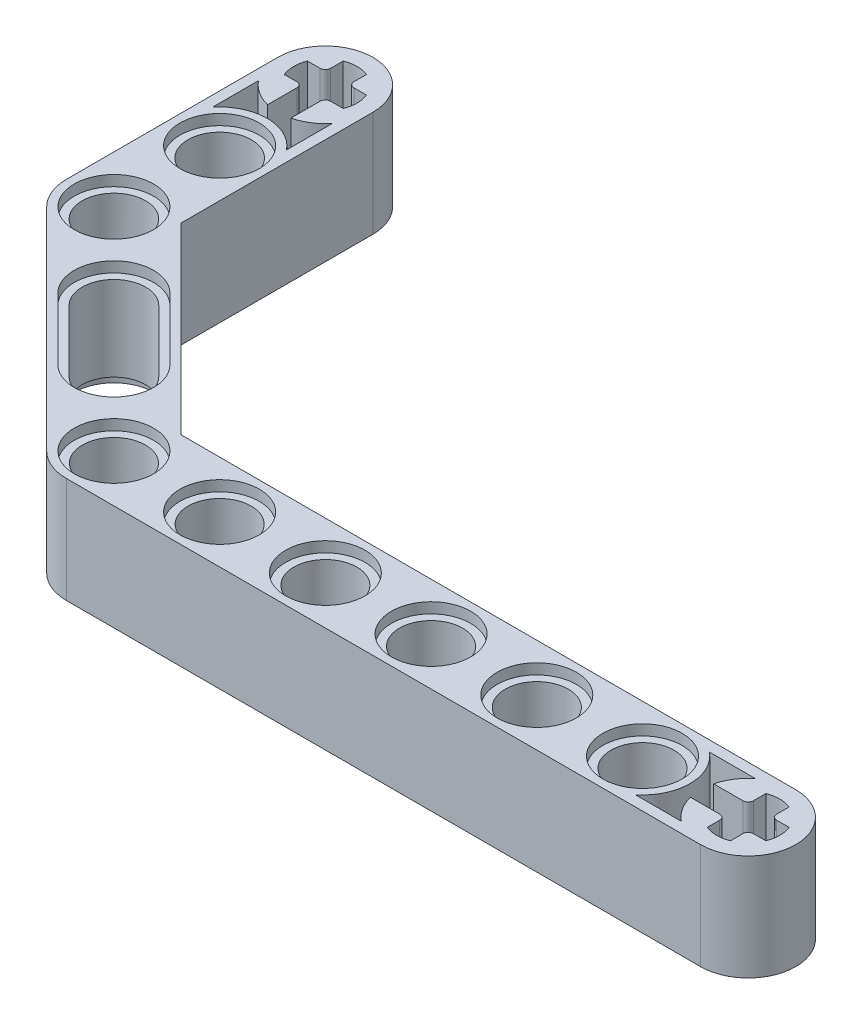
from build123d import *

# Parameters (mm, degrees)
SKETCH1_R           = 2.385120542
SKETCH1_R_2         = 2.4
BOSS_EXTRUDE1_DEPTH = 8
SKETCH2_R           = 3
CUT_EXTRUDE1_DEPTH  = 0.8


with BuildPart() as part:
    # Sketch1 → Boss-Extrude1 (new body)
    with BuildSketch(Plane(origin=(0, 0, 0), x_dir=(1, 0, 0), z_dir=(0, 1, 0))):
        with BuildLine():
            Line((-40.978171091, 17.491168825), (-27.087002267, 3.6))
            Line((-27.087002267, 3.6), (19.421828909, 3.6))
            ThreePointArc((19.421828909, 3.6), (23.021828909, 0), (19.421828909, -3.6))
            Line((19.421828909, -3.6), (-28.578171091, -3.6))
            ThreePointArc((-28.578171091, -3.6), (-29.955831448, -3.325966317), (-31.123755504, -2.545584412))
            Line((-31.123755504, -2.545584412), (-47.123755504, 13.454415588))
            ThreePointArc((-47.123755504, 13.454415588), (-47.904137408, 14.622339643), (-48.178171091, 16))
            Line((-48.178171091, 16), (-48.178171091, 32))
            ThreePointArc((-48.178171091, 32), (-44.578171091, 35.6), (-40.978171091, 32))
            Line((-40.978171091, 32), (-40.978171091, 17.491168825))
        make_face()
        with Locations(Location((11.421828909, 0, 0), (0, 0, 270))):
            Circle(SKETCH1_R, mode=Mode.SUBTRACT)
        with Locations(Location((3.421828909, 0, 0), (0, 0, 270))):
            Circle(SKETCH1_R, mode=Mode.SUBTRACT)
        with Locations(Location((-4.578171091, 0, 0), (0, 0, 270))):
            Circle(SKETCH1_R, mode=Mode.SUBTRACT)
        with Locations(Location((-12.578171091, 0, 0), (0, 0, 270))):
            Circle(SKETCH1_R, mode=Mode.SUBTRACT)
        with Locations(Location((-20.578171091, 0, 0), (0, 0, 270))):
            Circle(SKETCH1_R, mode=Mode.SUBTRACT)
        with Locations(Location((-28.578171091, 0, 0), (0, 0, 270))):
            Circle(SKETCH1_R, mode=Mode.SUBTRACT)
        with Locations(Location((-44.578171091, 16, 0), (0, 0, 270))):
            Circle(SKETCH1_R_2, mode=Mode.SUBTRACT)
        with Locations(Location((-44.578171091, 24, 0), (0, 0, 270))):
            Circle(SKETCH1_R_2, mode=Mode.SUBTRACT)
        with BuildLine():
            Line((-37.224260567, 12.040202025), (-32.537969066, 7.353910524))
            ThreePointArc((-32.537969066, 7.353910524), (-32.537969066, 3.959797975), (-35.932081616, 3.959797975))
            Line((-35.932081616, 3.959797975), (-40.618373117, 8.646089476))
            ThreePointArc((-40.618373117, 8.646089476), (-40.618373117, 12.040202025), (-37.224260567, 12.040202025))
        make_face(mode=Mode.SUBTRACT)
        with BuildLine():
            Line((18.541828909, 2.216844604), (18.541828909, 1.28))
            ThreePointArc((18.541828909, 1.28), (18.424671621, 0.997157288), (18.141828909, 0.88))
            Line((18.141828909, 0.88), (17.204984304, 0.88))
            Line((17.204984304, 0.88), (15.931041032, 0.88))
            ThreePointArc((15.931041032, 0.88), (16.389111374, 1.939748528), (17.159087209, 2.8))
            Line((17.159087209, 2.8), (13.684570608, 2.8))
            ThreePointArc((13.684570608, 2.8), (15.021828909, 0), (13.684570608, -2.8))
            Line((13.684570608, -2.8), (17.159087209, -2.8))
            ThreePointArc((17.159087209, -2.8), (16.389111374, -1.939748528), (15.931041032, -0.88))
            Line((15.931041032, -0.88), (17.196969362, -0.88))
            Line((17.196969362, -0.88), (18.141828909, -0.88))
            ThreePointArc((18.141828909, -0.88), (18.424671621, -0.997157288), (18.541828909, -1.28))
            Line((18.541828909, -1.28), (18.541828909, -2.216844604))
            ThreePointArc((18.541828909, -2.216844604), (19.421828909, -2.385120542), (20.301828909, -2.216844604))
            Line((20.301828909, -2.216844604), (20.301828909, -1.28))
            ThreePointArc((20.301828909, -1.28), (20.418986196, -0.997157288), (20.701828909, -0.88))
            Line((20.701828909, -0.88), (21.638673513, -0.88))
            ThreePointArc((21.638673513, -0.88), (21.806949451, 0), (21.638673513, 0.88))
            Line((21.638673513, 0.88), (20.701828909, 0.88))
            ThreePointArc((20.701828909, 0.88), (20.418986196, 0.997157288), (20.301828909, 1.28))
            Line((20.301828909, 1.28), (20.301828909, 2.216844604))
            ThreePointArc((20.301828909, 2.216844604), (19.421828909, 2.385120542), (18.541828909, 2.216844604))
        make_face(mode=Mode.SUBTRACT)
        with BuildLine():
            Line((-45.458171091, 34.232845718), (-45.458171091, 33.28))
            ThreePointArc((-45.458171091, 33.28), (-45.575328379, 32.997157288), (-45.858171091, 32.88))
            Line((-45.858171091, 32.88), (-46.811016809, 32.88))
            ThreePointArc((-46.811016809, 32.88), (-46.978171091, 32), (-46.811016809, 31.12))
            Line((-46.811016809, 31.12), (-45.858171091, 31.12))
            ThreePointArc((-45.858171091, 31.12), (-45.575328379, 31.002842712), (-45.458171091, 30.72))
            Line((-45.458171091, 30.72), (-45.458171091, 29.767154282))
            Line((-45.458171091, 29.767154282), (-45.458171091, 28.509212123))
            ThreePointArc((-45.458171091, 28.509212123), (-46.51791962, 28.967282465), (-47.378171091, 29.7372583))
            Line((-47.378171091, 29.7372583), (-47.378171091, 26.2627417))
            ThreePointArc((-47.378171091, 26.2627417), (-44.578171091, 27.6), (-41.778171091, 26.2627417))
            Line((-41.778171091, 26.2627417), (-41.778171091, 29.7372583))
            ThreePointArc((-41.778171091, 29.7372583), (-42.638422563, 28.967282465), (-43.698171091, 28.509212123))
            Line((-43.698171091, 28.509212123), (-43.698171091, 29.767154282))
            Line((-43.698171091, 29.767154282), (-43.698171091, 30.72))
            ThreePointArc((-43.698171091, 30.72), (-43.581013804, 31.002842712), (-43.298171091, 31.12))
            Line((-43.298171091, 31.12), (-42.345325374, 31.12))
            ThreePointArc((-42.345325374, 31.12), (-42.178171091, 32), (-42.345325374, 32.88))
            Line((-42.345325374, 32.88), (-43.298171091, 32.88))
            ThreePointArc((-43.298171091, 32.88), (-43.581013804, 32.997157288), (-43.698171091, 33.28))
            Line((-43.698171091, 33.28), (-43.698171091, 34.232845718))
            ThreePointArc((-43.698171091, 34.232845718), (-44.578171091, 34.4), (-45.458171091, 34.232845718))
        make_face(mode=Mode.SUBTRACT)
    extrude(amount=BOSS_EXTRUDE1_DEPTH)

    # Sketch2 → Cut-Extrude1 (cut)
    with BuildSketch(Plane(origin=(0, 8, 0), x_dir=(1, 0, 0), z_dir=(0, 1, 0))):
        with Locations(Location((11.421828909, 0, 0), (0, 0, 270))):
            Circle(SKETCH2_R)
        with Locations(Location((3.421828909, 0, 0), (0, 0, 270))):
            Circle(SKETCH2_R)
        with Locations(Location((-4.578171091, 0, 0), (0, 0, 270))):
            Circle(SKETCH2_R)
        with Locations(Location((-12.578171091, 0, 0), (0, 0, 270))):
            Circle(SKETCH2_R)
        with Locations(Location((-20.578171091, 0, 0), (0, 0, 270))):
            Circle(SKETCH2_R)
        with Locations(Location((-28.578171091, 0, 0), (0, 0, 270))):
            Circle(SKETCH2_R)
        with Locations(Location((-44.578171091, 24, 0), (0, 0, 270))):
            Circle(SKETCH2_R)
        with Locations(Location((-44.578171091, 16, 0), (0, 0, 270))):
            Circle(SKETCH2_R)
        with BuildLine():
            Line((-36.799996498, 12.464466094), (-32.113704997, 7.778174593))
            ThreePointArc((-32.113704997, 7.778174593), (-32.113704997, 3.535533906), (-36.356345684, 3.535533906))
            Line((-36.356345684, 3.535533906), (-41.042637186, 8.221825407))
            ThreePointArc((-41.042637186, 8.221825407), (-41.042637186, 12.464466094), (-36.799996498, 12.464466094))
        make_face()
    cut_extrude1 = extrude(amount=-CUT_EXTRUDE1_DEPTH, mode=Mode.SUBTRACT)

    # Mirror1: Cut-Extrude1 across plane
    add(cut_extrude1.mirror(Plane.ZX.offset(4)), mode=Mode.SUBTRACT)


solid = part.part
